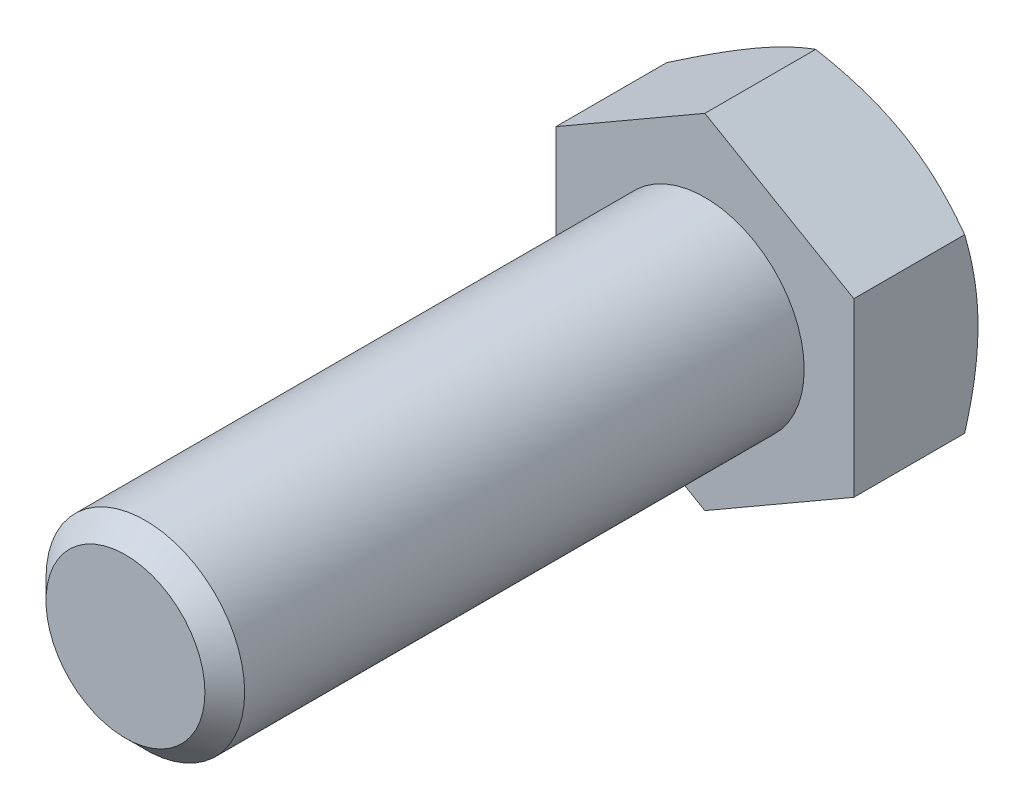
ISO-10303-21;
HEADER;
FILE_DESCRIPTION(('STEP AP214'),'2;1');
FILE_NAME('part.step','',(''),(''),'','','');
FILE_SCHEMA(('AUTOMOTIVE_DESIGN { 1 0 10303 214 1 1 1 1 }'));
ENDSEC;
DATA;
#1=APPLICATION_CONTEXT('core data for automotive mechanical design processes');
#2=APPLICATION_PROTOCOL_DEFINITION('international standard','automotive_design',2000,#1);
#3=PRODUCT_CONTEXT('',#1,'mechanical');
#4=PRODUCT('Part','Part','',(#3));
#5=PRODUCT_RELATED_PRODUCT_CATEGORY('part','',(#4));
#6=PRODUCT_DEFINITION_FORMATION('','',#4);
#7=PRODUCT_DEFINITION_CONTEXT('part definition',#1,'design');
#8=PRODUCT_DEFINITION('design','',#6,#7);
#9=PRODUCT_DEFINITION_SHAPE('','',#8);
#10=(LENGTH_UNIT() NAMED_UNIT(*) SI_UNIT(.MILLI.,.METRE.));
#11=(NAMED_UNIT(*) PLANE_ANGLE_UNIT() SI_UNIT($,.RADIAN.));
#12=(NAMED_UNIT(*) SI_UNIT($,.STERADIAN.) SOLID_ANGLE_UNIT());
#13=UNCERTAINTY_MEASURE_WITH_UNIT(LENGTH_MEASURE(1.E-05),#10,'distance_accuracy_value','');
#14=(GEOMETRIC_REPRESENTATION_CONTEXT(3) GLOBAL_UNCERTAINTY_ASSIGNED_CONTEXT((#13)) GLOBAL_UNIT_ASSIGNED_CONTEXT((#10,
#11,#12)) REPRESENTATION_CONTEXT('',''));
#15=CARTESIAN_POINT('',(0.,0.,0.));
#16=DIRECTION('',(0.,0.,1.));
#17=DIRECTION('',(1.,0.,0.));
#18=AXIS2_PLACEMENT_3D('',#15,#16,#17);
#19=CARTESIAN_POINT('',(0.,0.,35.));
#20=DIRECTION('',(0.,0.,1.));
#21=DIRECTION('',(1.,0.,0.));
#22=AXIS2_PLACEMENT_3D('',#19,#20,#21);
#23=PLANE('',#22);
#24=CARTESIAN_POINT('',(0.,0.,35.));
#25=DIRECTION('',(0.,0.,1.));
#26=DIRECTION('',(1.,0.,0.));
#27=AXIS2_PLACEMENT_3D('',#24,#25,#26);
#28=CIRCLE('',#27,4.80000000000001);
#29=CARTESIAN_POINT('',(4.80000000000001,0.,35.));
#30=VERTEX_POINT('',#29);
#31=EDGE_CURVE('E205',#30,#30,#28,.T.);
#32=ORIENTED_EDGE('',*,*,#31,.T.);
#33=EDGE_LOOP('',(#32));
#34=FACE_BOUND('',#33,.T.);
#35=ADVANCED_FACE('F31',(#34),#23,.T.);
#36=CARTESIAN_POINT('',(0.,0.,0.));
#37=DIRECTION('',(0.,0.,1.));
#38=DIRECTION('',(1.,0.,0.));
#39=AXIS2_PLACEMENT_3D('',#36,#37,#38);
#40=CYLINDRICAL_SURFACE('',#39,6.);
#41=CARTESIAN_POINT('',(0.,0.,33.8));
#42=DIRECTION('',(0.,0.,1.));
#43=DIRECTION('',(1.,0.,0.));
#44=AXIS2_PLACEMENT_3D('',#41,#42,#43);
#45=CIRCLE('',#44,6.);
#46=CARTESIAN_POINT('',(6.,0.,33.8));
#47=VERTEX_POINT('',#46);
#48=EDGE_CURVE('E207',#47,#47,#45,.F.);
#49=ORIENTED_EDGE('',*,*,#48,.T.);
#50=EDGE_LOOP('',(#49));
#51=FACE_BOUND('',#50,.T.);
#52=CARTESIAN_POINT('',(0.,0.,0.));
#53=DIRECTION('',(0.,0.,1.));
#54=DIRECTION('',(1.,0.,0.));
#55=AXIS2_PLACEMENT_3D('',#52,#53,#54);
#56=CIRCLE('',#55,6.);
#57=CARTESIAN_POINT('',(6.,0.,0.));
#58=VERTEX_POINT('',#57);
#59=EDGE_CURVE('E208',#58,#58,#56,.F.);
#60=ORIENTED_EDGE('',*,*,#59,.F.);
#61=EDGE_LOOP('',(#60));
#62=FACE_BOUND('',#61,.T.);
#63=ADVANCED_FACE('F196',(#51,#62),#40,.T.);
#64=CARTESIAN_POINT('',(0.,0.,35.));
#65=DIRECTION('',(0.,0.,-1.));
#66=DIRECTION('',(-1.,0.,0.));
#67=AXIS2_PLACEMENT_3D('',#64,#65,#66);
#68=CONICAL_SURFACE('',#67,4.80000000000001,0.785398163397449);
#69=ORIENTED_EDGE('',*,*,#48,.F.);
#70=EDGE_LOOP('',(#69));
#71=FACE_BOUND('',#70,.T.);
#72=ORIENTED_EDGE('',*,*,#31,.F.);
#73=EDGE_LOOP('',(#72));
#74=FACE_BOUND('',#73,.T.);
#75=ADVANCED_FACE('F201',(#71,#74),#68,.T.);
#76=CARTESIAN_POINT('',(0.,10.3923048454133,-7.5));
#77=DIRECTION('',(0.499999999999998,0.86602540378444,0.));
#78=DIRECTION('',(-0.86602540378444,0.499999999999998,0.));
#79=AXIS2_PLACEMENT_3D('',#76,#77,#78);
#80=PLANE('',#79);
#81=CARTESIAN_POINT('',(-0.00020000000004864,10.3924203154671,-6.69608575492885));
#82=CARTESIAN_POINT('',(0.197607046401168,10.2782163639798,-6.76201799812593));
#83=CARTESIAN_POINT('',(0.396185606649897,10.1635669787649,-6.82495859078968));
#84=CARTESIAN_POINT('',(0.794955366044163,9.93333715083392,-6.94403100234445));
#85=CARTESIAN_POINT('',(0.995147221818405,9.8177563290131,-7.00015988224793));
#86=CARTESIAN_POINT('',(1.39751505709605,9.5854491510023,-7.10484803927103));
#87=CARTESIAN_POINT('',(1.59969459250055,9.46872074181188,-7.15338922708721));
#88=CARTESIAN_POINT('',(2.0054287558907,9.23447001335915,-7.24185148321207));
#89=CARTESIAN_POINT('',(2.20898309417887,9.11694786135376,-7.28177431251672));
#90=CARTESIAN_POINT('',(2.61230590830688,8.88408932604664,-7.35131532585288));
#91=CARTESIAN_POINT('',(2.81204459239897,8.76877014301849,-7.3811624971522));
#92=CARTESIAN_POINT('',(3.21241567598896,8.53761579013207,-7.43120669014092));
#93=CARTESIAN_POINT('',(3.41304799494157,8.42178066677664,-7.45140456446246));
#94=CARTESIAN_POINT('',(3.81466063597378,8.18990950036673,-7.48164565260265));
#95=CARTESIAN_POINT('',(4.0156403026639,8.07387383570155,-7.4917003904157));
#96=CARTESIAN_POINT('',(4.41778459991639,7.84169571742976,-7.50143766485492));
#97=CARTESIAN_POINT('',(4.61894922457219,7.7255532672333,-7.50112052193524));
#98=CARTESIAN_POINT('',(4.99503261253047,7.50842142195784,-7.49083604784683));
#99=CARTESIAN_POINT('',(5.16997789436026,7.40741671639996,-7.4821232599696));
#100=CARTESIAN_POINT('',(5.51945867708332,7.2056438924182,-7.45702265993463));
#101=CARTESIAN_POINT('',(5.69399414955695,7.10487579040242,-7.44063433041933));
#102=CARTESIAN_POINT('',(6.21692487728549,6.80296159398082,-7.38034344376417));
#103=CARTESIAN_POINT('',(6.5643945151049,6.60234990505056,-7.32532251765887));
#104=CARTESIAN_POINT('',(7.26301962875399,6.19899850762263,-7.18776952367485));
#105=CARTESIAN_POINT('',(7.61408594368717,5.99631027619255,-7.10465438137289));
#106=CARTESIAN_POINT('',(8.3109833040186,5.59395639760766,-6.91601746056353));
#107=CARTESIAN_POINT('',(8.65682327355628,5.39428559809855,-6.81053998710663));
#108=CARTESIAN_POINT('',(9.0002,5.19603695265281,-6.69608575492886));
#109=B_SPLINE_CURVE_WITH_KNOTS('',3,(#81,#82,#83,#84,#85,#86,#87,#88,#89,#90,#91,#92,#93,#94,
#95,#96,#97,#98,#99,#100,#101,#102,#103,#104,#105,#106,#107,#108),.UNSPECIFIED.,.F.,.F.,(4,2,2,
2,2,2,2,2,2,2,2,2,2,4),(0.,0.713219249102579,1.42674513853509,2.14194697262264,2.85700253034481,
3.55449749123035,4.25193080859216,4.94857085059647,5.64518936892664,6.25162976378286,
6.85811104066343,8.07193747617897,9.31268391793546,10.5509947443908),.UNSPECIFIED.);
#110=CARTESIAN_POINT('',(0.,10.3923048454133,-6.69615242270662));
#111=VERTEX_POINT('',#110);
#112=CARTESIAN_POINT('',(4.49999999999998,7.79422863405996,-7.5));
#113=VERTEX_POINT('',#112);
#114=EDGE_CURVE('E241',#111,#113,#109,.T.);
#115=ORIENTED_EDGE('',*,*,#114,.F.);
#116=DIRECTION('',(0.,0.,1.));
#117=VECTOR('',#116,1.);
#118=CARTESIAN_POINT('',(0.,10.3923048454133,-7.5));
#119=LINE('',#118,#117);
#120=CARTESIAN_POINT('',(0.,10.3923048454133,0.));
#121=VERTEX_POINT('',#120);
#122=EDGE_CURVE('E215',#111,#121,#119,.T.);
#123=ORIENTED_EDGE('',*,*,#122,.T.);
#124=DIRECTION('',(-0.86602540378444,0.499999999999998,0.));
#125=VECTOR('',#124,1.);
#126=CARTESIAN_POINT('',(0.,10.3923048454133,0.));
#127=LINE('',#126,#125);
#128=CARTESIAN_POINT('',(9.00000000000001,5.19615242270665,0.));
#129=VERTEX_POINT('',#128);
#130=EDGE_CURVE('E239',#129,#121,#127,.T.);
#131=ORIENTED_EDGE('',*,*,#130,.F.);
#132=DIRECTION('',(0.,0.,1.));
#133=VECTOR('',#132,1.);
#134=CARTESIAN_POINT('',(9.00000000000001,5.19615242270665,-7.5));
#135=LINE('',#134,#133);
#136=CARTESIAN_POINT('',(9.00000000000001,5.19615242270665,-6.69615242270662));
#137=VERTEX_POINT('',#136);
#138=EDGE_CURVE('E212',#137,#129,#135,.T.);
#139=ORIENTED_EDGE('',*,*,#138,.F.);
#140=EDGE_CURVE('E171',#113,#137,#109,.T.);
#141=ORIENTED_EDGE('',*,*,#140,.F.);
#142=EDGE_LOOP('',(#115,#123,#131,#139,#141));
#143=FACE_BOUND('',#142,.T.);
#144=ADVANCED_FACE('F181',(#143),#80,.T.);
#145=CARTESIAN_POINT('',(9.00000000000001,-5.19615242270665,-7.5));
#146=DIRECTION('',(1.,0.,0.));
#147=DIRECTION('',(0.,0.,-1.));
#148=AXIS2_PLACEMENT_3D('',#145,#146,#147);
#149=PLANE('',#148);
#150=CARTESIAN_POINT('',(9.00000000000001,-14.1938054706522,-2.99281770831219));
#151=CARTESIAN_POINT('',(9.00000000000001,-13.7986249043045,-3.18545400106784));
#152=CARTESIAN_POINT('',(9.00000000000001,-13.4025620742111,-3.37631016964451));
#153=CARTESIAN_POINT('',(9.00000000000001,-12.6082034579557,-3.75346543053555));
#154=CARTESIAN_POINT('',(9.00000000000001,-12.2099073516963,-3.93976384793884));
#155=CARTESIAN_POINT('',(9.00000000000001,-11.4086732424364,-4.30769386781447));
#156=CARTESIAN_POINT('',(9.00000000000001,-11.005721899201,-4.48929651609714));
#157=CARTESIAN_POINT('',(9.00000000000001,-10.1966954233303,-4.84537774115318));
#158=CARTESIAN_POINT('',(9.00000000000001,-9.79062043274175,-5.01985663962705));
#159=CARTESIAN_POINT('',(9.00000000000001,-8.96081603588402,-5.36560228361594));
#160=CARTESIAN_POINT('',(9.00000000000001,-8.53695616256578,-5.5365575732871));
#161=CARTESIAN_POINT('',(9.00000000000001,-7.68436682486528,-5.86609252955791));
#162=CARTESIAN_POINT('',(9.00000000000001,-7.25563683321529,-6.02467084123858));
#163=CARTESIAN_POINT('',(9.00000000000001,-6.39334839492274,-6.3254614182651));
#164=CARTESIAN_POINT('',(9.00000000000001,-5.95980093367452,-6.46770484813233));
#165=CARTESIAN_POINT('',(9.00000000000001,-5.08650675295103,-6.73142002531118));
#166=CARTESIAN_POINT('',(9.00000000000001,-4.64676195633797,-6.85289806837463));
#167=CARTESIAN_POINT('',(9.00000000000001,-3.7631885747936,-7.06875933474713));
#168=CARTESIAN_POINT('',(9.00000000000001,-3.31939822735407,-7.16329494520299));
#169=CARTESIAN_POINT('',(9.00000000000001,-2.64948950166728,-7.28091249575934));
#170=CARTESIAN_POINT('',(9.00000000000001,-2.42546830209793,-7.31608884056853));
#171=CARTESIAN_POINT('',(9.00000000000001,-1.97623392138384,-7.37769613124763));
#172=CARTESIAN_POINT('',(9.00000000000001,-1.75102085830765,-7.40412792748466));
#173=CARTESIAN_POINT('',(9.00000000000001,-1.30274989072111,-7.44737513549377));
#174=CARTESIAN_POINT('',(9.00000000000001,-1.07970414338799,-7.46431601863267));
#175=CARTESIAN_POINT('',(9.00000000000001,-0.633095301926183,-7.4887410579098));
#176=CARTESIAN_POINT('',(9.00000000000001,-0.409532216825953,-7.49622537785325));
#177=CARTESIAN_POINT('',(9.00000000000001,0.0377121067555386,-7.50155767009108));
#178=CARTESIAN_POINT('',(9.00000000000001,0.261393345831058,-7.49940559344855));
#179=CARTESIAN_POINT('',(9.00000000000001,0.708460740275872,-7.48552018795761));
#180=CARTESIAN_POINT('',(9.00000000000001,0.931846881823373,-7.47378642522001));
#181=CARTESIAN_POINT('',(9.00000000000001,1.46162752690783,-7.43485039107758));
#182=CARTESIAN_POINT('',(9.00000000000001,1.76772399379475,-7.40349650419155));
#183=CARTESIAN_POINT('',(9.00000000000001,2.37778404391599,-7.32445593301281));
#184=CARTESIAN_POINT('',(9.00000000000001,2.6817473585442,-7.27676722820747));
#185=CARTESIAN_POINT('',(9.00000000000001,3.59000335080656,-7.1117163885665));
#186=CARTESIAN_POINT('',(9.00000000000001,4.19036603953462,-6.9723942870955));
#187=CARTESIAN_POINT('',(9.00000000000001,5.08858153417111,-6.72898039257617));
#188=CARTESIAN_POINT('',(9.00000000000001,5.39104017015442,-6.64089135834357));
#189=CARTESIAN_POINT('',(9.00000000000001,5.99302412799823,-6.4551143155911));
#190=CARTESIAN_POINT('',(9.00000000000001,6.29254942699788,-6.35742623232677));
#191=CARTESIAN_POINT('',(9.00000000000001,6.88875586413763,-6.15405553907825));
#192=CARTESIAN_POINT('',(9.00000000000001,7.18543776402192,-6.0483751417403));
#193=CARTESIAN_POINT('',(9.00000000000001,7.77631041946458,-5.83030807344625));
#194=CARTESIAN_POINT('',(9.00000000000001,8.07050123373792,-5.71792156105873));
#195=CARTESIAN_POINT('',(9.00000000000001,8.86768097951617,-5.40462740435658));
#196=CARTESIAN_POINT('',(9.00000000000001,9.36851420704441,-5.19823951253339));
#197=CARTESIAN_POINT('',(9.00000000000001,10.3649647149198,-4.77318997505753));
#198=CARTESIAN_POINT('',(9.00000000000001,10.860581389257,-4.5545269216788));
#199=CARTESIAN_POINT('',(9.00000000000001,11.8478077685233,-4.10785524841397));
#200=CARTESIAN_POINT('',(9.00000000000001,12.3394158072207,-3.87984295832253));
#201=CARTESIAN_POINT('',(9.00000000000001,13.3192435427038,-3.41672758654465));
#202=CARTESIAN_POINT('',(9.00000000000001,13.8074633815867,-3.18162480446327));
#203=CARTESIAN_POINT('',(9.00000000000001,14.7819931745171,-2.70549247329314));
#204=CARTESIAN_POINT('',(9.00000000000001,15.2682986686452,-2.46445381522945));
#205=CARTESIAN_POINT('',(9.00000000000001,16.2387067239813,-1.97797920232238));
#206=CARTESIAN_POINT('',(9.00000000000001,16.7228092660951,-1.73254320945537));
#207=CARTESIAN_POINT('',(9.00000000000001,17.6890969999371,-1.23819989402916));
#208=CARTESIAN_POINT('',(9.00000000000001,18.1712826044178,-0.989293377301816));
#209=CARTESIAN_POINT('',(9.00000000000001,19.1341609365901,-0.48860773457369));
#210=CARTESIAN_POINT('',(9.00000000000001,19.6148536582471,-0.236828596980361));
#211=CARTESIAN_POINT('',(9.00000000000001,20.9522159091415,0.46783942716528));
#212=CARTESIAN_POINT('',(9.00000000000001,21.8075292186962,0.92330168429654));
#213=CARTESIAN_POINT('',(9.00000000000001,23.5152984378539,1.83966951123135));
#214=CARTESIAN_POINT('',(9.00000000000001,24.3677541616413,2.3005754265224));
#215=CARTESIAN_POINT('',(9.00000000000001,26.0675482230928,3.22485857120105));
#216=CARTESIAN_POINT('',(9.00000000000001,26.9148940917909,3.68822195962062));
#217=CARTESIAN_POINT('',(9.00000000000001,28.1846057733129,4.38556367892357));
#218=CARTESIAN_POINT('',(9.00000000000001,28.6076082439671,4.61838432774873));
#219=CARTESIAN_POINT('',(9.00000000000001,29.4532343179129,5.08471147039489));
#220=CARTESIAN_POINT('',(9.00000000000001,29.8758579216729,5.31821796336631));
#221=CARTESIAN_POINT('',(9.00000000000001,30.2983153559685,5.55202477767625));
#222=B_SPLINE_CURVE_WITH_KNOTS('',3,(#150,#151,#152,#153,#154,#155,#156,#157,#158,#159,#160,
#161,#162,#163,#164,#165,#166,#167,#168,#169,#170,#171,#172,#173,#174,#175,#176,#177,#178,#179,
#180,#181,#182,#183,#184,#185,#186,#187,#188,#189,#190,#191,#192,#193,#194,#195,#196,#197,#198,
#199,#200,#201,#202,#203,#204,#205,#206,#207,#208,#209,#210,#211,#212,#213,#214,#215,#216,#217,
#218,#219,#220,#221),.UNSPECIFIED.,.F.,.F.,(4,2,2,2,2,2,2,2,2,2,2,2,2,2,2,2,2,2,2,2,2,2,2,2,2,2,
2,2,2,2,2,2,2,2,2,4),(0.,1.31891143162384,2.63801699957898,3.9639117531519,5.28974656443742,
6.66070766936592,8.03181864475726,9.40026868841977,10.7683030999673,12.1284389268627,
12.8085936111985,13.488682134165,14.1595537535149,14.8304137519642,15.5012771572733,
16.172170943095,17.094749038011,18.0174412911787,19.8637129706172,20.808703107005,
21.7537006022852,22.6984374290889,23.6431519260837,25.267980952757,26.8929966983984,
28.5186565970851,30.1442479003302,31.7725119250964,33.4007900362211,35.0286961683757,
36.6566088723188,39.5636489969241,42.4708746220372,45.3681585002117,46.8166845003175,
48.2652087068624),.UNSPECIFIED.);
#223=CARTESIAN_POINT('',(9.,0.,-7.5));
#224=VERTEX_POINT('',#223);
#225=EDGE_CURVE('E169',#137,#224,#222,.F.);
#226=ORIENTED_EDGE('',*,*,#225,.F.);
#227=ORIENTED_EDGE('',*,*,#138,.T.);
#228=DIRECTION('',(0.,1.,0.));
#229=VECTOR('',#228,1.);
#230=CARTESIAN_POINT('',(9.00000000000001,-5.19615242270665,0.));
#231=LINE('',#230,#229);
#232=CARTESIAN_POINT('',(9.00000000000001,-5.19615242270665,0.));
#233=VERTEX_POINT('',#232);
#234=EDGE_CURVE('E217',#233,#129,#231,.T.);
#235=ORIENTED_EDGE('',*,*,#234,.F.);
#236=DIRECTION('',(0.,0.,1.));
#237=VECTOR('',#236,1.);
#238=CARTESIAN_POINT('',(9.00000000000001,-5.19615242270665,-7.5));
#239=LINE('',#238,#237);
#240=CARTESIAN_POINT('',(9.00000000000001,-5.19615242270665,-6.69615242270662));
#241=VERTEX_POINT('',#240);
#242=EDGE_CURVE('E223',#241,#233,#239,.T.);
#243=ORIENTED_EDGE('',*,*,#242,.F.);
#244=EDGE_CURVE('E164',#224,#241,#222,.F.);
#245=ORIENTED_EDGE('',*,*,#244,.F.);
#246=EDGE_LOOP('',(#226,#227,#235,#243,#245));
#247=FACE_BOUND('',#246,.T.);
#248=ADVANCED_FACE('F177',(#247),#149,.T.);
#249=CARTESIAN_POINT('',(0.,-10.3923048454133,-7.5));
#250=DIRECTION('',(0.499999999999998,-0.86602540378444,0.));
#251=DIRECTION('',(0.86602540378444,0.499999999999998,0.));
#252=AXIS2_PLACEMENT_3D('',#249,#250,#251);
#253=PLANE('',#252);
#254=CARTESIAN_POINT('',(9.0002,-5.19603695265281,-6.69608575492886));
#255=CARTESIAN_POINT('',(8.80239295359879,-5.31024090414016,-6.76201799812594));
#256=CARTESIAN_POINT('',(8.60381439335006,-5.42489028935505,-6.82495859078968));
#257=CARTESIAN_POINT('',(8.20504463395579,-5.65512011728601,-6.94403100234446));
#258=CARTESIAN_POINT('',(8.00485277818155,-5.77070093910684,-7.00015988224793));
#259=CARTESIAN_POINT('',(7.6024849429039,-6.00300811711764,-7.10484803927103));
#260=CARTESIAN_POINT('',(7.4003054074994,-6.11973652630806,-7.15338922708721));
#261=CARTESIAN_POINT('',(6.99457124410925,-6.35398725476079,-7.24185148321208));
#262=CARTESIAN_POINT('',(6.79101690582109,-6.47150940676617,-7.28177431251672));
#263=CARTESIAN_POINT('',(6.38769409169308,-6.70436794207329,-7.35131532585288));
#264=CARTESIAN_POINT('',(6.18795540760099,-6.81968712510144,-7.3811624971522));
#265=CARTESIAN_POINT('',(5.787584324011,-7.05084147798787,-7.43120669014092));
#266=CARTESIAN_POINT('',(5.58695200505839,-7.16667660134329,-7.45140456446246));
#267=CARTESIAN_POINT('',(5.18533936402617,-7.3985477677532,-7.48164565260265));
#268=CARTESIAN_POINT('',(4.98435969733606,-7.51458343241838,-7.4917003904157));
#269=CARTESIAN_POINT('',(4.58221540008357,-7.74676155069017,-7.50143766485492));
#270=CARTESIAN_POINT('',(4.38105077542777,-7.86290400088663,-7.50112052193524));
#271=CARTESIAN_POINT('',(4.00496738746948,-8.08003584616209,-7.49083604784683));
#272=CARTESIAN_POINT('',(3.83002210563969,-8.18104055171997,-7.4821232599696));
#273=CARTESIAN_POINT('',(3.48054132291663,-8.38281337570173,-7.45702265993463));
#274=CARTESIAN_POINT('',(3.30600585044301,-8.48358147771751,-7.44063433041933));
#275=CARTESIAN_POINT('',(2.78307512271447,-8.78549567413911,-7.38034344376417));
#276=CARTESIAN_POINT('',(2.43560548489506,-8.98610736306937,-7.32532251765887));
#277=CARTESIAN_POINT('',(1.73698037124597,-9.38945876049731,-7.18776952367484));
#278=CARTESIAN_POINT('',(1.38591405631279,-9.59214699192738,-7.10465438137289));
#279=CARTESIAN_POINT('',(0.689016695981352,-9.99450087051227,-6.91601746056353));
#280=CARTESIAN_POINT('',(0.343176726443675,-10.1941716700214,-6.81053998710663));
#281=CARTESIAN_POINT('',(-0.000200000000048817,-10.3924203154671,-6.69608575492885));
#282=B_SPLINE_CURVE_WITH_KNOTS('',3,(#254,#255,#256,#257,#258,#259,#260,#261,#262,#263,#264,
#265,#266,#267,#268,#269,#270,#271,#272,#273,#274,#275,#276,#277,#278,#279,#280,#281),
.UNSPECIFIED.,.F.,.F.,(4,2,2,2,2,2,2,2,2,2,2,2,2,4),(0.,0.71321924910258,1.42674513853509,
2.14194697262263,2.85700253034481,3.55449749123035,4.25193080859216,4.94857085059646,
5.64518936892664,6.25162976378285,6.85811104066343,8.07193747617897,9.31268391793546,
10.5509947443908),.UNSPECIFIED.);
#283=CARTESIAN_POINT('',(4.49999999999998,-7.79422863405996,-7.5));
#284=VERTEX_POINT('',#283);
#285=EDGE_CURVE('E170',#241,#284,#282,.T.);
#286=ORIENTED_EDGE('',*,*,#285,.F.);
#287=ORIENTED_EDGE('',*,*,#242,.T.);
#288=DIRECTION('',(0.86602540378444,0.499999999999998,0.));
#289=VECTOR('',#288,1.);
#290=CARTESIAN_POINT('',(0.,-10.3923048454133,0.));
#291=LINE('',#290,#289);
#292=CARTESIAN_POINT('',(0.,-10.3923048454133,0.));
#293=VERTEX_POINT('',#292);
#294=EDGE_CURVE('E228',#293,#233,#291,.T.);
#295=ORIENTED_EDGE('',*,*,#294,.F.);
#296=DIRECTION('',(0.,0.,1.));
#297=VECTOR('',#296,1.);
#298=CARTESIAN_POINT('',(0.,-10.3923048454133,-7.5));
#299=LINE('',#298,#297);
#300=CARTESIAN_POINT('',(0.,-10.3923048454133,-6.69615242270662));
#301=VERTEX_POINT('',#300);
#302=EDGE_CURVE('E221',#301,#293,#299,.T.);
#303=ORIENTED_EDGE('',*,*,#302,.F.);
#304=EDGE_CURVE('E158',#284,#301,#282,.T.);
#305=ORIENTED_EDGE('',*,*,#304,.F.);
#306=EDGE_LOOP('',(#286,#287,#295,#303,#305));
#307=FACE_BOUND('',#306,.T.);
#308=ADVANCED_FACE('F180',(#307),#253,.T.);
#309=CARTESIAN_POINT('',(0.,-10.3923048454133,-7.5));
#310=DIRECTION('',(-0.500000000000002,-0.866025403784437,0.));
#311=DIRECTION('',(0.866025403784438,-0.500000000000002,0.));
#312=AXIS2_PLACEMENT_3D('',#309,#310,#311);
#313=PLANE('',#312);
#314=CARTESIAN_POINT('',(0.000199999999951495,-10.3924203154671,-6.69608575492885));
#315=CARTESIAN_POINT('',(-0.197607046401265,-10.2782163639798,-6.76201799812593));
#316=CARTESIAN_POINT('',(-0.396185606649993,-10.1635669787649,-6.82495859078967));
#317=CARTESIAN_POINT('',(-0.794955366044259,-9.93333715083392,-6.94403100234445));
#318=CARTESIAN_POINT('',(-0.9951472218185,-9.81775632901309,-7.00015988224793));
#319=CARTESIAN_POINT('',(-1.39751505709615,-9.58544915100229,-7.10484803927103));
#320=CARTESIAN_POINT('',(-1.59969459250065,-9.46872074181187,-7.1533892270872));
#321=CARTESIAN_POINT('',(-2.0054287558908,-9.23447001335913,-7.24185148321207));
#322=CARTESIAN_POINT('',(-2.20898309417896,-9.11694786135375,-7.28177431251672));
#323=CARTESIAN_POINT('',(-2.61230590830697,-8.88408932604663,-7.35131532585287));
#324=CARTESIAN_POINT('',(-2.81204459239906,-8.76877014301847,-7.38116249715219));
#325=CARTESIAN_POINT('',(-3.21241567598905,-8.53761579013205,-7.43120669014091));
#326=CARTESIAN_POINT('',(-3.41304799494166,-8.42178066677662,-7.45140456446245));
#327=CARTESIAN_POINT('',(-3.81466063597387,-8.18990950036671,-7.48164565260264));
#328=CARTESIAN_POINT('',(-4.01564030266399,-8.07387383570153,-7.49170039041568));
#329=CARTESIAN_POINT('',(-4.41778459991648,-7.84169571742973,-7.5014376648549));
#330=CARTESIAN_POINT('',(-4.61894922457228,-7.72555326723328,-7.50112052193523));
#331=CARTESIAN_POINT('',(-4.99503261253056,-7.50842142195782,-7.49083604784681));
#332=CARTESIAN_POINT('',(-5.16997789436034,-7.40741671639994,-7.48212325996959));
#333=CARTESIAN_POINT('',(-5.51945867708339,-7.20564389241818,-7.45702265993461));
#334=CARTESIAN_POINT('',(-5.69399414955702,-7.1048757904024,-7.44063433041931));
#335=CARTESIAN_POINT('',(-6.21692487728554,-6.8029615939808,-7.38034344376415));
#336=CARTESIAN_POINT('',(-6.56439451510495,-6.60234990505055,-7.32532251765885));
#337=CARTESIAN_POINT('',(-7.26301962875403,-6.19899850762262,-7.18776952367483));
#338=CARTESIAN_POINT('',(-7.6140859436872,-5.99631027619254,-7.10465438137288));
#339=CARTESIAN_POINT('',(-8.31098330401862,-5.59395639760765,-6.91601746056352));
#340=CARTESIAN_POINT('',(-8.65682327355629,-5.39428559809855,-6.81053998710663));
#341=CARTESIAN_POINT('',(-9.0002,-5.19603695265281,-6.69608575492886));
#342=B_SPLINE_CURVE_WITH_KNOTS('',3,(#314,#315,#316,#317,#318,#319,#320,#321,#322,#323,#324,
#325,#326,#327,#328,#329,#330,#331,#332,#333,#334,#335,#336,#337,#338,#339,#340,#341),
.UNSPECIFIED.,.F.,.F.,(4,2,2,2,2,2,2,2,2,2,2,2,2,4),(0.,0.713219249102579,1.42674513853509,
2.14194697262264,2.85700253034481,3.55449749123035,4.25193080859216,4.94857085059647,
5.64518936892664,6.25162976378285,6.85811104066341,8.07193747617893,9.31268391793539,
10.5509947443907),.UNSPECIFIED.);
#343=CARTESIAN_POINT('',(-4.50000000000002,-7.79422863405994,-7.5));
#344=VERTEX_POINT('',#343);
#345=EDGE_CURVE('E260',#301,#344,#342,.T.);
#346=ORIENTED_EDGE('',*,*,#345,.F.);
#347=ORIENTED_EDGE('',*,*,#302,.T.);
#348=DIRECTION('',(0.866025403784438,-0.500000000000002,0.));
#349=VECTOR('',#348,1.);
#350=CARTESIAN_POINT('',(0.,-10.3923048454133,0.));
#351=LINE('',#350,#349);
#352=CARTESIAN_POINT('',(-9.00000000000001,-5.19615242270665,0.));
#353=VERTEX_POINT('',#352);
#354=EDGE_CURVE('E231',#353,#293,#351,.T.);
#355=ORIENTED_EDGE('',*,*,#354,.F.);
#356=DIRECTION('',(0.,0.,1.));
#357=VECTOR('',#356,1.);
#358=CARTESIAN_POINT('',(-9.00000000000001,-5.19615242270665,-7.5));
#359=LINE('',#358,#357);
#360=CARTESIAN_POINT('',(-9.00000000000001,-5.19615242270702,-6.69615242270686));
#361=VERTEX_POINT('',#360);
#362=EDGE_CURVE('E219',#361,#353,#359,.T.);
#363=ORIENTED_EDGE('',*,*,#362,.F.);
#364=EDGE_CURVE('E107',#344,#361,#342,.T.);
#365=ORIENTED_EDGE('',*,*,#364,.F.);
#366=EDGE_LOOP('',(#346,#347,#355,#363,#365));
#367=FACE_BOUND('',#366,.T.);
#368=ADVANCED_FACE('F185',(#367),#313,.T.);
#369=CARTESIAN_POINT('',(-9.00000000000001,-5.19615242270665,-7.5));
#370=DIRECTION('',(-1.,0.,0.));
#371=DIRECTION('',(0.,0.,1.));
#372=AXIS2_PLACEMENT_3D('',#369,#370,#371);
#373=PLANE('',#372);
#374=CARTESIAN_POINT('',(-9.00000000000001,-14.1938054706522,-2.99281770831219));
#375=CARTESIAN_POINT('',(-9.00000000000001,-13.7986249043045,-3.18545400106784));
#376=CARTESIAN_POINT('',(-9.00000000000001,-13.4025620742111,-3.37631016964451));
#377=CARTESIAN_POINT('',(-9.00000000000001,-12.6082034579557,-3.75346543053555));
#378=CARTESIAN_POINT('',(-9.00000000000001,-12.2099073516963,-3.93976384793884));
#379=CARTESIAN_POINT('',(-9.00000000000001,-11.4086732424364,-4.30769386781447));
#380=CARTESIAN_POINT('',(-9.00000000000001,-11.005721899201,-4.48929651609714));
#381=CARTESIAN_POINT('',(-9.00000000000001,-10.1966954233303,-4.84537774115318));
#382=CARTESIAN_POINT('',(-9.00000000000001,-9.79062043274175,-5.01985663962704));
#383=CARTESIAN_POINT('',(-9.00000000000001,-8.96081603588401,-5.36560228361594));
#384=CARTESIAN_POINT('',(-9.00000000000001,-8.53695616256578,-5.5365575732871));
#385=CARTESIAN_POINT('',(-9.00000000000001,-7.68436682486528,-5.86609252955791));
#386=CARTESIAN_POINT('',(-9.00000000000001,-7.25563683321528,-6.02467084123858));
#387=CARTESIAN_POINT('',(-9.00000000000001,-6.39334839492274,-6.3254614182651));
#388=CARTESIAN_POINT('',(-9.00000000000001,-5.95980093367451,-6.46770484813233));
#389=CARTESIAN_POINT('',(-9.00000000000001,-5.08650675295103,-6.73142002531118));
#390=CARTESIAN_POINT('',(-9.00000000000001,-4.64676195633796,-6.85289806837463));
#391=CARTESIAN_POINT('',(-9.00000000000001,-3.76318857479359,-7.06875933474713));
#392=CARTESIAN_POINT('',(-9.00000000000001,-3.31939822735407,-7.16329494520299));
#393=CARTESIAN_POINT('',(-9.00000000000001,-2.64948950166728,-7.28091249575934));
#394=CARTESIAN_POINT('',(-9.00000000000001,-2.42546830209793,-7.31608884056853));
#395=CARTESIAN_POINT('',(-9.00000000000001,-1.97623392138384,-7.37769613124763));
#396=CARTESIAN_POINT('',(-9.00000000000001,-1.75102085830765,-7.40412792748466));
#397=CARTESIAN_POINT('',(-9.00000000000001,-1.30274989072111,-7.44737513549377));
#398=CARTESIAN_POINT('',(-9.00000000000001,-1.07970414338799,-7.46431601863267));
#399=CARTESIAN_POINT('',(-9.00000000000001,-0.633095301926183,-7.4887410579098));
#400=CARTESIAN_POINT('',(-9.00000000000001,-0.409532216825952,-7.49622537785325));
#401=CARTESIAN_POINT('',(-9.00000000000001,0.0377121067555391,-7.50155767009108));
#402=CARTESIAN_POINT('',(-9.00000000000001,0.261393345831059,-7.49940559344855));
#403=CARTESIAN_POINT('',(-9.00000000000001,0.708460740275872,-7.48552018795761));
#404=CARTESIAN_POINT('',(-9.00000000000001,0.931846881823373,-7.47378642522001));
#405=CARTESIAN_POINT('',(-9.00000000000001,1.46162752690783,-7.43485039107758));
#406=CARTESIAN_POINT('',(-9.00000000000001,1.76772399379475,-7.40349650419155));
#407=CARTESIAN_POINT('',(-9.00000000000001,2.37778404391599,-7.32445593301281));
#408=CARTESIAN_POINT('',(-9.00000000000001,2.6817473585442,-7.27676722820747));
#409=CARTESIAN_POINT('',(-9.00000000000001,3.59000335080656,-7.1117163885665));
#410=CARTESIAN_POINT('',(-9.00000000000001,4.19036603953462,-6.9723942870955));
#411=CARTESIAN_POINT('',(-9.00000000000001,5.08858153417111,-6.72898039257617));
#412=CARTESIAN_POINT('',(-9.00000000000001,5.39104017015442,-6.64089135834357));
#413=CARTESIAN_POINT('',(-9.00000000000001,5.99302412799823,-6.4551143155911));
#414=CARTESIAN_POINT('',(-9.00000000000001,6.29254942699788,-6.35742623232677));
#415=CARTESIAN_POINT('',(-9.00000000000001,6.88875586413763,-6.15405553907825));
#416=CARTESIAN_POINT('',(-9.00000000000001,7.18543776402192,-6.0483751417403));
#417=CARTESIAN_POINT('',(-9.00000000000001,7.77631041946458,-5.83030807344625));
#418=CARTESIAN_POINT('',(-9.00000000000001,8.07050123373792,-5.71792156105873));
#419=CARTESIAN_POINT('',(-9.00000000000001,8.86768097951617,-5.40462740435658));
#420=CARTESIAN_POINT('',(-9.00000000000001,9.36851420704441,-5.19823951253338));
#421=CARTESIAN_POINT('',(-9.00000000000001,10.3649647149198,-4.77318997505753));
#422=CARTESIAN_POINT('',(-9.00000000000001,10.860581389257,-4.55452692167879));
#423=CARTESIAN_POINT('',(-9.00000000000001,11.8478077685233,-4.10785524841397));
#424=CARTESIAN_POINT('',(-9.00000000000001,12.3394158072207,-3.87984295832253));
#425=CARTESIAN_POINT('',(-9.00000000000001,13.3192435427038,-3.41672758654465));
#426=CARTESIAN_POINT('',(-9.00000000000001,13.8074633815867,-3.18162480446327));
#427=CARTESIAN_POINT('',(-9.00000000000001,14.7819931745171,-2.70549247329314));
#428=CARTESIAN_POINT('',(-9.00000000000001,15.2682986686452,-2.46445381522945));
#429=CARTESIAN_POINT('',(-9.00000000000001,16.2387067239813,-1.97797920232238));
#430=CARTESIAN_POINT('',(-9.00000000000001,16.722809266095,-1.73254320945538));
#431=CARTESIAN_POINT('',(-9.00000000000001,17.6890969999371,-1.23819989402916));
#432=CARTESIAN_POINT('',(-9.00000000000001,18.1712826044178,-0.989293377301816));
#433=CARTESIAN_POINT('',(-9.00000000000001,19.1341609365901,-0.48860773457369));
#434=CARTESIAN_POINT('',(-9.00000000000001,19.6148536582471,-0.236828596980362));
#435=CARTESIAN_POINT('',(-9.00000000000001,20.9522159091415,0.467839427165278));
#436=CARTESIAN_POINT('',(-9.00000000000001,21.8075292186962,0.923301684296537));
#437=CARTESIAN_POINT('',(-9.00000000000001,23.5152984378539,1.83966951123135));
#438=CARTESIAN_POINT('',(-9.00000000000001,24.3677541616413,2.3005754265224));
#439=CARTESIAN_POINT('',(-9.00000000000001,26.0675482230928,3.22485857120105));
#440=CARTESIAN_POINT('',(-9.00000000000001,26.9148940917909,3.68822195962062));
#441=CARTESIAN_POINT('',(-9.00000000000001,28.184605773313,4.38556367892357));
#442=CARTESIAN_POINT('',(-9.00000000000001,28.6076082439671,4.61838432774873));
#443=CARTESIAN_POINT('',(-9.00000000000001,29.4532343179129,5.08471147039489));
#444=CARTESIAN_POINT('',(-9.00000000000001,29.8758579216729,5.31821796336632));
#445=CARTESIAN_POINT('',(-9.00000000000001,30.2983153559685,5.55202477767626));
#446=B_SPLINE_CURVE_WITH_KNOTS('',3,(#374,#375,#376,#377,#378,#379,#380,#381,#382,#383,#384,
#385,#386,#387,#388,#389,#390,#391,#392,#393,#394,#395,#396,#397,#398,#399,#400,#401,#402,#403,
#404,#405,#406,#407,#408,#409,#410,#411,#412,#413,#414,#415,#416,#417,#418,#419,#420,#421,#422,
#423,#424,#425,#426,#427,#428,#429,#430,#431,#432,#433,#434,#435,#436,#437,#438,#439,#440,#441,
#442,#443,#444,#445),.UNSPECIFIED.,.F.,.F.,(4,2,2,2,2,2,2,2,2,2,2,2,2,2,2,2,2,2,2,2,2,2,2,2,2,2,
2,2,2,2,2,2,2,2,2,4),(0.,1.31891143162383,2.63801699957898,3.9639117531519,5.28974656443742,
6.66070766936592,8.03181864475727,9.40026868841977,10.7683030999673,12.1284389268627,
12.8085936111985,13.488682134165,14.1595537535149,14.8304137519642,15.5012771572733,
16.172170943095,17.094749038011,18.0174412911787,19.8637129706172,20.808703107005,
21.7537006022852,22.6984374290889,23.6431519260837,25.267980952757,26.8929966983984,
28.5186565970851,30.1442479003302,31.7725119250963,33.400790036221,35.0286961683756,
36.6566088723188,39.5636489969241,42.4708746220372,45.3681585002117,46.8166845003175,
48.2652087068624),.UNSPECIFIED.);
#447=CARTESIAN_POINT('',(-9.00000000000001,0.,-7.5));
#448=VERTEX_POINT('',#447);
#449=EDGE_CURVE('E102',#361,#448,#446,.T.);
#450=ORIENTED_EDGE('',*,*,#449,.F.);
#451=ORIENTED_EDGE('',*,*,#362,.T.);
#452=DIRECTION('',(0.,-1.,0.));
#453=VECTOR('',#452,1.);
#454=CARTESIAN_POINT('',(-9.00000000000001,-5.19615242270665,0.));
#455=LINE('',#454,#453);
#456=CARTESIAN_POINT('',(-9.00000000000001,5.19615242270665,0.));
#457=VERTEX_POINT('',#456);
#458=EDGE_CURVE('E234',#457,#353,#455,.T.);
#459=ORIENTED_EDGE('',*,*,#458,.F.);
#460=DIRECTION('',(0.,0.,1.));
#461=VECTOR('',#460,1.);
#462=CARTESIAN_POINT('',(-9.00000000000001,5.19615242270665,-7.5));
#463=LINE('',#462,#461);
#464=CARTESIAN_POINT('',(-9.00000000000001,5.19615242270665,-6.69615242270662));
#465=VERTEX_POINT('',#464);
#466=EDGE_CURVE('E128',#465,#457,#463,.T.);
#467=ORIENTED_EDGE('',*,*,#466,.F.);
#468=EDGE_CURVE('E111',#448,#465,#446,.T.);
#469=ORIENTED_EDGE('',*,*,#468,.F.);
#470=EDGE_LOOP('',(#450,#451,#459,#467,#469));
#471=FACE_BOUND('',#470,.T.);
#472=ADVANCED_FACE('F126',(#471),#373,.T.);
#473=CARTESIAN_POINT('',(-9.00000000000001,5.19615242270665,-7.5));
#474=DIRECTION('',(-0.500000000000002,0.866025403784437,0.));
#475=DIRECTION('',(-0.866025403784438,-0.500000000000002,0.));
#476=AXIS2_PLACEMENT_3D('',#473,#474,#475);
#477=PLANE('',#476);
#478=CARTESIAN_POINT('',(-9.0002,5.19603695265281,-6.69608575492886));
#479=CARTESIAN_POINT('',(-8.80239295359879,5.31024090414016,-6.76201799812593));
#480=CARTESIAN_POINT('',(-8.60381439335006,5.42489028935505,-6.82495859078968));
#481=CARTESIAN_POINT('',(-8.20504463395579,5.65512011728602,-6.94403100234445));
#482=CARTESIAN_POINT('',(-8.00485277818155,5.77070093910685,-7.00015988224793));
#483=CARTESIAN_POINT('',(-7.6024849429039,6.00300811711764,-7.10484803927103));
#484=CARTESIAN_POINT('',(-7.40030540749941,6.11973652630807,-7.15338922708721));
#485=CARTESIAN_POINT('',(-6.99457124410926,6.3539872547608,-7.24185148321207));
#486=CARTESIAN_POINT('',(-6.79101690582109,6.47150940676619,-7.28177431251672));
#487=CARTESIAN_POINT('',(-6.38769409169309,6.70436794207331,-7.35131532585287));
#488=CARTESIAN_POINT('',(-6.187955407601,6.81968712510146,-7.38116249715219));
#489=CARTESIAN_POINT('',(-5.787584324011,7.05084147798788,-7.43120669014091));
#490=CARTESIAN_POINT('',(-5.58695200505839,7.16667660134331,-7.45140456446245));
#491=CARTESIAN_POINT('',(-5.18533936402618,7.39854776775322,-7.48164565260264));
#492=CARTESIAN_POINT('',(-4.98435969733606,7.5145834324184,-7.49170039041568));
#493=CARTESIAN_POINT('',(-4.58221540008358,7.7467615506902,-7.5014376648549));
#494=CARTESIAN_POINT('',(-4.38105077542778,7.86290400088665,-7.50112052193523));
#495=CARTESIAN_POINT('',(-4.0049673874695,8.08003584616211,-7.49083604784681));
#496=CARTESIAN_POINT('',(-3.83002210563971,8.18104055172,-7.48212325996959));
#497=CARTESIAN_POINT('',(-3.48054132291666,8.38281337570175,-7.45702265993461));
#498=CARTESIAN_POINT('',(-3.30600585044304,8.48358147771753,-7.44063433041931));
#499=CARTESIAN_POINT('',(-2.78307512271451,8.78549567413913,-7.38034344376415));
#500=CARTESIAN_POINT('',(-2.4356054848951,8.98610736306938,-7.32532251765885));
#501=CARTESIAN_POINT('',(-1.73698037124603,9.38945876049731,-7.18776952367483));
#502=CARTESIAN_POINT('',(-1.38591405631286,9.59214699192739,-7.10465438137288));
#503=CARTESIAN_POINT('',(-0.689016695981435,9.99450087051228,-6.91601746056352));
#504=CARTESIAN_POINT('',(-0.343176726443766,10.1941716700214,-6.81053998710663));
#505=CARTESIAN_POINT('',(0.000199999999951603,10.3924203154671,-6.69608575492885));
#506=B_SPLINE_CURVE_WITH_KNOTS('',3,(#478,#479,#480,#481,#482,#483,#484,#485,#486,#487,#488,
#489,#490,#491,#492,#493,#494,#495,#496,#497,#498,#499,#500,#501,#502,#503,#504,#505),
.UNSPECIFIED.,.F.,.F.,(4,2,2,2,2,2,2,2,2,2,2,2,2,4),(0.,0.71321924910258,1.42674513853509,
2.14194697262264,2.85700253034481,3.55449749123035,4.25193080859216,4.94857085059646,
5.64518936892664,6.25162976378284,6.8581110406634,8.07193747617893,9.31268391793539,
10.5509947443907),.UNSPECIFIED.);
#507=CARTESIAN_POINT('',(-4.50000000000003,7.79422863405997,-7.5));
#508=VERTEX_POINT('',#507);
#509=EDGE_CURVE('E117',#465,#508,#506,.T.);
#510=ORIENTED_EDGE('',*,*,#509,.F.);
#511=ORIENTED_EDGE('',*,*,#466,.T.);
#512=DIRECTION('',(-0.866025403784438,-0.500000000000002,0.));
#513=VECTOR('',#512,1.);
#514=CARTESIAN_POINT('',(-9.00000000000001,5.19615242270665,0.));
#515=LINE('',#514,#513);
#516=EDGE_CURVE('E237',#121,#457,#515,.T.);
#517=ORIENTED_EDGE('',*,*,#516,.F.);
#518=ORIENTED_EDGE('',*,*,#122,.F.);
#519=EDGE_CURVE('E119',#508,#111,#506,.T.);
#520=ORIENTED_EDGE('',*,*,#519,.F.);
#521=EDGE_LOOP('',(#510,#511,#517,#518,#520));
#522=FACE_BOUND('',#521,.T.);
#523=ADVANCED_FACE('F193',(#522),#477,.T.);
#524=CARTESIAN_POINT('',(9.00000000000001,5.19615242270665,0.));
#525=DIRECTION('',(0.,0.,1.));
#526=DIRECTION('',(1.,0.,0.));
#527=AXIS2_PLACEMENT_3D('',#524,#525,#526);
#528=PLANE('',#527);
#529=ORIENTED_EDGE('',*,*,#59,.T.);
#530=EDGE_LOOP('',(#529));
#531=FACE_BOUND('',#530,.T.);
#532=ORIENTED_EDGE('',*,*,#130,.T.);
#533=ORIENTED_EDGE('',*,*,#516,.T.);
#534=ORIENTED_EDGE('',*,*,#458,.T.);
#535=ORIENTED_EDGE('',*,*,#354,.T.);
#536=ORIENTED_EDGE('',*,*,#294,.T.);
#537=ORIENTED_EDGE('',*,*,#234,.T.);
#538=EDGE_LOOP('',(#532,#533,#534,#535,#536,#537));
#539=FACE_BOUND('',#538,.T.);
#540=ADVANCED_FACE('F150',(#531,#539),#528,.T.);
#541=CARTESIAN_POINT('',(0.,0.,0.));
#542=DIRECTION('',(0.,0.,1.));
#543=DIRECTION('',(1.,0.,0.));
#544=AXIS2_PLACEMENT_3D('',#541,#542,#543);
#545=CONICAL_SURFACE('',#544,21.9903810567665,1.0471975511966);
#546=ORIENTED_EDGE('',*,*,#140,.T.);
#547=ORIENTED_EDGE('',*,*,#225,.T.);
#548=CARTESIAN_POINT('',(0.,0.,-7.5));
#549=DIRECTION('',(0.,0.,1.));
#550=DIRECTION('',(1.,0.,0.));
#551=AXIS2_PLACEMENT_3D('',#548,#549,#550);
#552=CIRCLE('',#551,9.);
#553=EDGE_CURVE('E34',#113,#224,#552,.F.);
#554=ORIENTED_EDGE('',*,*,#553,.F.);
#555=EDGE_LOOP('',(#546,#547,#554));
#556=FACE_BOUND('',#555,.T.);
#557=ADVANCED_FACE('F250',(#556),#545,.T.);
#558=ORIENTED_EDGE('',*,*,#114,.T.);
#559=EDGE_CURVE('E124',#508,#113,#552,.F.);
#560=ORIENTED_EDGE('',*,*,#559,.F.);
#561=ORIENTED_EDGE('',*,*,#519,.T.);
#562=EDGE_LOOP('',(#558,#560,#561));
#563=FACE_BOUND('',#562,.T.);
#564=ADVANCED_FACE('F149',(#563),#545,.T.);
#565=ORIENTED_EDGE('',*,*,#468,.T.);
#566=ORIENTED_EDGE('',*,*,#509,.T.);
#567=CARTESIAN_POINT('',(0.,0.,-7.5));
#568=DIRECTION('',(0.,0.,-1.));
#569=DIRECTION('',(-1.,0.,0.));
#570=AXIS2_PLACEMENT_3D('',#567,#568,#569);
#571=CIRCLE('',#570,9.00000000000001);
#572=EDGE_CURVE('E52',#448,#508,#571,.T.);
#573=ORIENTED_EDGE('',*,*,#572,.F.);
#574=EDGE_LOOP('',(#565,#566,#573));
#575=FACE_BOUND('',#574,.T.);
#576=ADVANCED_FACE('F115',(#575),#545,.T.);
#577=ORIENTED_EDGE('',*,*,#364,.T.);
#578=ORIENTED_EDGE('',*,*,#449,.T.);
#579=EDGE_CURVE('E104',#344,#448,#552,.F.);
#580=ORIENTED_EDGE('',*,*,#579,.F.);
#581=EDGE_LOOP('',(#577,#578,#580));
#582=FACE_BOUND('',#581,.T.);
#583=ADVANCED_FACE('F103',(#582),#545,.T.);
#584=ORIENTED_EDGE('',*,*,#304,.T.);
#585=ORIENTED_EDGE('',*,*,#345,.T.);
#586=EDGE_CURVE('E39',#284,#344,#552,.F.);
#587=ORIENTED_EDGE('',*,*,#586,.F.);
#588=EDGE_LOOP('',(#584,#585,#587));
#589=FACE_BOUND('',#588,.T.);
#590=ADVANCED_FACE('F262',(#589),#545,.T.);
#591=ORIENTED_EDGE('',*,*,#244,.T.);
#592=ORIENTED_EDGE('',*,*,#285,.T.);
#593=EDGE_CURVE('E11',#224,#284,#552,.F.);
#594=ORIENTED_EDGE('',*,*,#593,.F.);
#595=EDGE_LOOP('',(#591,#592,#594));
#596=FACE_BOUND('',#595,.T.);
#597=ADVANCED_FACE('F257',(#596),#545,.T.);
#598=CARTESIAN_POINT('',(9.00000000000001,5.19615242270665,-7.5));
#599=DIRECTION('',(0.,0.,1.));
#600=DIRECTION('',(1.,0.,0.));
#601=AXIS2_PLACEMENT_3D('',#598,#599,#600);
#602=PLANE('',#601);
#603=ORIENTED_EDGE('',*,*,#553,.T.);
#604=ORIENTED_EDGE('',*,*,#593,.T.);
#605=ORIENTED_EDGE('',*,*,#586,.T.);
#606=ORIENTED_EDGE('',*,*,#579,.T.);
#607=ORIENTED_EDGE('',*,*,#572,.T.);
#608=ORIENTED_EDGE('',*,*,#559,.T.);
#609=EDGE_LOOP('',(#603,#604,#605,#606,#607,#608));
#610=FACE_BOUND('',#609,.T.);
#611=ADVANCED_FACE('F122',(#610),#602,.F.);
#612=CLOSED_SHELL('',(#35,#63,#75,#144,#248,#308,#368,#472,#523,#540,#557,#564,#576,#583,#590,
#597,#611));
#613=MANIFOLD_SOLID_BREP('B2',#612);
#614=ADVANCED_BREP_SHAPE_REPRESENTATION('',(#18,#613),#14);
#615=SHAPE_DEFINITION_REPRESENTATION(#9,#614);
ENDSEC;
END-ISO-10303-21;
